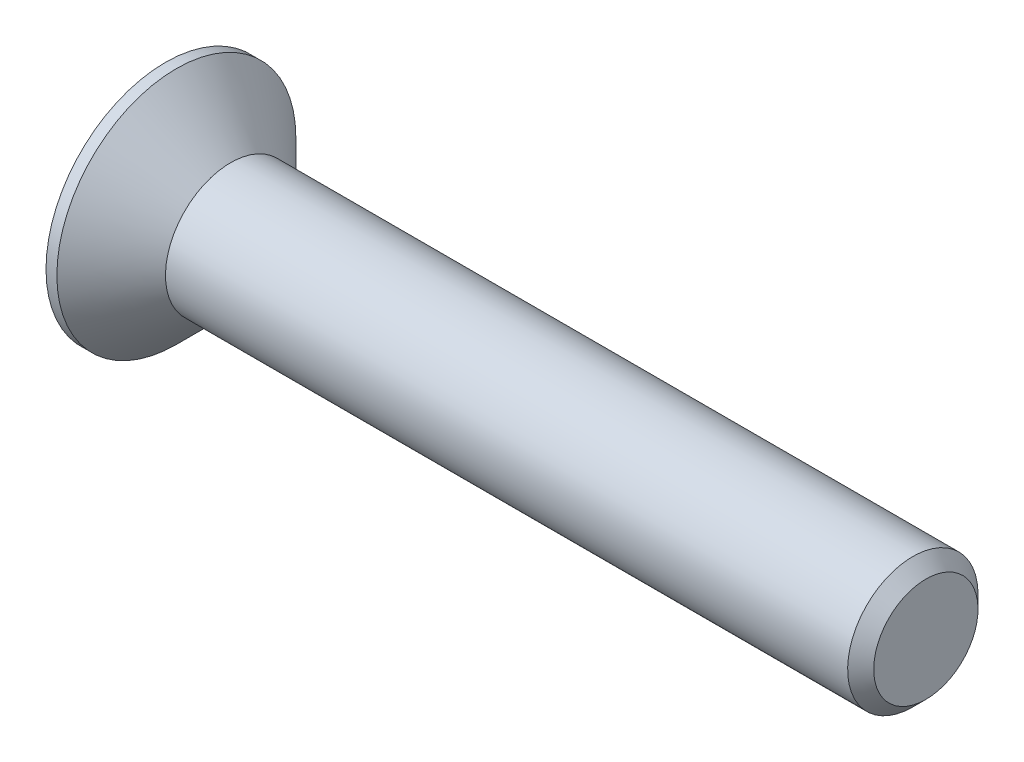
ISO-10303-21;
HEADER;
FILE_DESCRIPTION(('STEP AP214'),'2;1');
FILE_NAME('part.step','',(''),(''),'','','');
FILE_SCHEMA(('AUTOMOTIVE_DESIGN { 1 0 10303 214 1 1 1 1 }'));
ENDSEC;
DATA;
#1=APPLICATION_CONTEXT('core data for automotive mechanical design processes');
#2=APPLICATION_PROTOCOL_DEFINITION('international standard','automotive_design',2000,#1);
#3=PRODUCT_CONTEXT('',#1,'mechanical');
#4=PRODUCT('Part','Part','',(#3));
#5=PRODUCT_RELATED_PRODUCT_CATEGORY('part','',(#4));
#6=PRODUCT_DEFINITION_FORMATION('','',#4);
#7=PRODUCT_DEFINITION_CONTEXT('part definition',#1,'design');
#8=PRODUCT_DEFINITION('design','',#6,#7);
#9=PRODUCT_DEFINITION_SHAPE('','',#8);
#10=(LENGTH_UNIT() NAMED_UNIT(*) SI_UNIT(.MILLI.,.METRE.));
#11=(NAMED_UNIT(*) PLANE_ANGLE_UNIT() SI_UNIT($,.RADIAN.));
#12=(NAMED_UNIT(*) SI_UNIT($,.STERADIAN.) SOLID_ANGLE_UNIT());
#13=UNCERTAINTY_MEASURE_WITH_UNIT(LENGTH_MEASURE(1.E-05),#10,'distance_accuracy_value','');
#14=(GEOMETRIC_REPRESENTATION_CONTEXT(3) GLOBAL_UNCERTAINTY_ASSIGNED_CONTEXT((#13)) GLOBAL_UNIT_ASSIGNED_CONTEXT((#10,
#11,#12)) REPRESENTATION_CONTEXT('',''));
#15=CARTESIAN_POINT('',(0.,0.,0.));
#16=DIRECTION('',(0.,0.,1.));
#17=DIRECTION('',(1.,0.,0.));
#18=AXIS2_PLACEMENT_3D('',#15,#16,#17);
#19=CARTESIAN_POINT('',(0.,0.,0.));
#20=DIRECTION('',(-1.,0.,0.));
#21=DIRECTION('',(0.,-1.,0.));
#22=AXIS2_PLACEMENT_3D('',#19,#20,#21);
#23=CONICAL_SURFACE('',#22,3.,0.78539816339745);
#24=CARTESIAN_POINT('',(-2.49999999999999,0.,0.));
#25=DIRECTION('',(-1.,0.,0.));
#26=DIRECTION('',(0.,-1.,0.));
#27=AXIS2_PLACEMENT_3D('',#24,#25,#26);
#28=CIRCLE('',#27,5.5);
#29=CARTESIAN_POINT('',(-2.49999999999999,-5.5,0.));
#30=VERTEX_POINT('',#29);
#31=EDGE_CURVE('E189',#30,#30,#28,.T.);
#32=ORIENTED_EDGE('',*,*,#31,.F.);
#33=EDGE_LOOP('',(#32));
#34=FACE_BOUND('',#33,.T.);
#35=CARTESIAN_POINT('',(0.,0.,0.));
#36=DIRECTION('',(-1.,0.,0.));
#37=DIRECTION('',(0.,-1.,0.));
#38=AXIS2_PLACEMENT_3D('',#35,#36,#37);
#39=CIRCLE('',#38,3.);
#40=CARTESIAN_POINT('',(0.,-3.,0.));
#41=VERTEX_POINT('',#40);
#42=EDGE_CURVE('E212',#41,#41,#39,.T.);
#43=ORIENTED_EDGE('',*,*,#42,.T.);
#44=EDGE_LOOP('',(#43));
#45=FACE_BOUND('',#44,.T.);
#46=ADVANCED_FACE('F33',(#34,#45),#23,.T.);
#47=CARTESIAN_POINT('',(-3.,0.,0.));
#48=DIRECTION('',(-1.,0.,0.));
#49=DIRECTION('',(0.,-1.,0.));
#50=AXIS2_PLACEMENT_3D('',#47,#48,#49);
#51=CYLINDRICAL_SURFACE('',#50,3.);
#52=CARTESIAN_POINT('',(31.4,0.,0.));
#53=DIRECTION('',(-1.,0.,0.));
#54=DIRECTION('',(0.,-1.,0.));
#55=AXIS2_PLACEMENT_3D('',#52,#53,#54);
#56=CIRCLE('',#55,3.);
#57=CARTESIAN_POINT('',(31.4,-3.,0.));
#58=VERTEX_POINT('',#57);
#59=EDGE_CURVE('E41',#58,#58,#56,.T.);
#60=ORIENTED_EDGE('',*,*,#59,.T.);
#61=EDGE_LOOP('',(#60));
#62=FACE_BOUND('',#61,.T.);
#63=ORIENTED_EDGE('',*,*,#42,.F.);
#64=EDGE_LOOP('',(#63));
#65=FACE_BOUND('',#64,.T.);
#66=ADVANCED_FACE('F217',(#62,#65),#51,.T.);
#67=CARTESIAN_POINT('',(32.,0.,0.));
#68=DIRECTION('',(-1.,0.,0.));
#69=DIRECTION('',(0.,-1.,0.));
#70=AXIS2_PLACEMENT_3D('',#67,#68,#69);
#71=PLANE('',#70);
#72=CARTESIAN_POINT('',(32.,0.,0.));
#73=DIRECTION('',(-1.,0.,0.));
#74=DIRECTION('',(0.,-1.,0.));
#75=AXIS2_PLACEMENT_3D('',#72,#73,#74);
#76=CIRCLE('',#75,2.4);
#77=CARTESIAN_POINT('',(32.,-2.4,0.));
#78=VERTEX_POINT('',#77);
#79=EDGE_CURVE('E11',#78,#78,#76,.F.);
#80=ORIENTED_EDGE('',*,*,#79,.T.);
#81=EDGE_LOOP('',(#80));
#82=FACE_BOUND('',#81,.T.);
#83=ADVANCED_FACE('F239',(#82),#71,.F.);
#84=CARTESIAN_POINT('',(-3.,5.5,0.));
#85=DIRECTION('',(1.,0.,0.));
#86=DIRECTION('',(0.,1.,0.));
#87=AXIS2_PLACEMENT_3D('',#84,#85,#86);
#88=PLANE('',#87);
#89=DIRECTION('',(0.,0.,-1.));
#90=VECTOR('',#89,1.);
#91=CARTESIAN_POINT('',(-3.,0.825,-3.3));
#92=LINE('',#91,#90);
#93=CARTESIAN_POINT('',(-3.,0.825,-0.825));
#94=VERTEX_POINT('',#93);
#95=CARTESIAN_POINT('',(-3.,0.825,-3.3));
#96=VERTEX_POINT('',#95);
#97=EDGE_CURVE('E158',#94,#96,#92,.T.);
#98=ORIENTED_EDGE('',*,*,#97,.F.);
#99=DIRECTION('',(0.,-1.,0.));
#100=VECTOR('',#99,1.);
#101=CARTESIAN_POINT('',(-3.,0.825,-0.825));
#102=LINE('',#101,#100);
#103=CARTESIAN_POINT('',(-3.,3.3,-0.825));
#104=VERTEX_POINT('',#103);
#105=EDGE_CURVE('E48',#104,#94,#102,.T.);
#106=ORIENTED_EDGE('',*,*,#105,.F.);
#107=DIRECTION('',(0.,0.,-1.));
#108=VECTOR('',#107,1.);
#109=CARTESIAN_POINT('',(-3.,3.3,-0.825));
#110=LINE('',#109,#108);
#111=CARTESIAN_POINT('',(-3.,3.3,0.825));
#112=VERTEX_POINT('',#111);
#113=EDGE_CURVE('E185',#112,#104,#110,.T.);
#114=ORIENTED_EDGE('',*,*,#113,.F.);
#115=DIRECTION('',(0.,1.,0.));
#116=VECTOR('',#115,1.);
#117=CARTESIAN_POINT('',(-3.,3.3,0.825));
#118=LINE('',#117,#116);
#119=CARTESIAN_POINT('',(-3.,0.825,0.825));
#120=VERTEX_POINT('',#119);
#121=EDGE_CURVE('E183',#120,#112,#118,.T.);
#122=ORIENTED_EDGE('',*,*,#121,.F.);
#123=DIRECTION('',(0.,0.,-1.));
#124=VECTOR('',#123,1.);
#125=CARTESIAN_POINT('',(-3.,0.825,0.825));
#126=LINE('',#125,#124);
#127=CARTESIAN_POINT('',(-3.,0.825,3.3));
#128=VERTEX_POINT('',#127);
#129=EDGE_CURVE('E132',#128,#120,#126,.T.);
#130=ORIENTED_EDGE('',*,*,#129,.F.);
#131=DIRECTION('',(0.,1.,0.));
#132=VECTOR('',#131,1.);
#133=CARTESIAN_POINT('',(-3.,0.825,3.3));
#134=LINE('',#133,#132);
#135=CARTESIAN_POINT('',(-3.,-0.825,3.3));
#136=VERTEX_POINT('',#135);
#137=EDGE_CURVE('E179',#136,#128,#134,.T.);
#138=ORIENTED_EDGE('',*,*,#137,.F.);
#139=DIRECTION('',(0.,0.,1.));
#140=VECTOR('',#139,1.);
#141=CARTESIAN_POINT('',(-3.,-0.825,3.3));
#142=LINE('',#141,#140);
#143=CARTESIAN_POINT('',(-3.,-0.825,0.825));
#144=VERTEX_POINT('',#143);
#145=EDGE_CURVE('E176',#144,#136,#142,.T.);
#146=ORIENTED_EDGE('',*,*,#145,.F.);
#147=DIRECTION('',(0.,1.,0.));
#148=VECTOR('',#147,1.);
#149=CARTESIAN_POINT('',(-3.,-0.825,0.825));
#150=LINE('',#149,#148);
#151=CARTESIAN_POINT('',(-3.,-3.3,0.825));
#152=VERTEX_POINT('',#151);
#153=EDGE_CURVE('E173',#152,#144,#150,.T.);
#154=ORIENTED_EDGE('',*,*,#153,.F.);
#155=DIRECTION('',(0.,0.,1.));
#156=VECTOR('',#155,1.);
#157=CARTESIAN_POINT('',(-3.,-3.3,0.825));
#158=LINE('',#157,#156);
#159=CARTESIAN_POINT('',(-3.,-3.3,-0.825));
#160=VERTEX_POINT('',#159);
#161=EDGE_CURVE('E170',#160,#152,#158,.T.);
#162=ORIENTED_EDGE('',*,*,#161,.F.);
#163=DIRECTION('',(0.,-1.,0.));
#164=VECTOR('',#163,1.);
#165=CARTESIAN_POINT('',(-3.,-3.3,-0.825));
#166=LINE('',#165,#164);
#167=CARTESIAN_POINT('',(-3.,-0.825,-0.825));
#168=VERTEX_POINT('',#167);
#169=EDGE_CURVE('E167',#168,#160,#166,.T.);
#170=ORIENTED_EDGE('',*,*,#169,.F.);
#171=DIRECTION('',(0.,0.,1.));
#172=VECTOR('',#171,1.);
#173=CARTESIAN_POINT('',(-3.,-0.825,-0.825));
#174=LINE('',#173,#172);
#175=CARTESIAN_POINT('',(-3.,-0.825,-3.3));
#176=VERTEX_POINT('',#175);
#177=EDGE_CURVE('E164',#176,#168,#174,.T.);
#178=ORIENTED_EDGE('',*,*,#177,.F.);
#179=DIRECTION('',(0.,-1.,0.));
#180=VECTOR('',#179,1.);
#181=CARTESIAN_POINT('',(-3.,-0.825,-3.3));
#182=LINE('',#181,#180);
#183=EDGE_CURVE('E161',#96,#176,#182,.T.);
#184=ORIENTED_EDGE('',*,*,#183,.F.);
#185=EDGE_LOOP('',(#98,#106,#114,#122,#130,#138,#146,#154,#162,#170,#178,#184));
#186=FACE_BOUND('',#185,.T.);
#187=CARTESIAN_POINT('',(-3.,0.,0.));
#188=DIRECTION('',(-1.,0.,0.));
#189=DIRECTION('',(0.,-1.,0.));
#190=AXIS2_PLACEMENT_3D('',#187,#188,#189);
#191=CIRCLE('',#190,5.5);
#192=CARTESIAN_POINT('',(-3.,-5.5,0.));
#193=VERTEX_POINT('',#192);
#194=EDGE_CURVE('E209',#193,#193,#191,.T.);
#195=ORIENTED_EDGE('',*,*,#194,.T.);
#196=EDGE_LOOP('',(#195));
#197=FACE_BOUND('',#196,.T.);
#198=ADVANCED_FACE('F230',(#186,#197),#88,.F.);
#199=CARTESIAN_POINT('',(-3.,0.,0.));
#200=DIRECTION('',(-1.,0.,0.));
#201=DIRECTION('',(0.,-1.,0.));
#202=AXIS2_PLACEMENT_3D('',#199,#200,#201);
#203=CYLINDRICAL_SURFACE('',#202,5.5);
#204=ORIENTED_EDGE('',*,*,#194,.F.);
#205=EDGE_LOOP('',(#204));
#206=FACE_BOUND('',#205,.T.);
#207=ORIENTED_EDGE('',*,*,#31,.T.);
#208=EDGE_LOOP('',(#207));
#209=FACE_BOUND('',#208,.T.);
#210=ADVANCED_FACE('F222',(#206,#209),#203,.T.);
#211=CARTESIAN_POINT('',(31.4,0.,0.));
#212=DIRECTION('',(-1.,0.,0.));
#213=DIRECTION('',(0.,-1.,0.));
#214=AXIS2_PLACEMENT_3D('',#211,#212,#213);
#215=CONICAL_SURFACE('',#214,3.,0.785398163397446);
#216=ORIENTED_EDGE('',*,*,#79,.F.);
#217=EDGE_LOOP('',(#216));
#218=FACE_BOUND('',#217,.T.);
#219=ORIENTED_EDGE('',*,*,#59,.F.);
#220=EDGE_LOOP('',(#219));
#221=FACE_BOUND('',#220,.T.);
#222=ADVANCED_FACE('F35',(#218,#221),#215,.T.);
#223=CARTESIAN_POINT('',(-0.5,0.825,-0.825));
#224=DIRECTION('',(0.,0.,-1.));
#225=DIRECTION('',(-1.,0.,0.));
#226=AXIS2_PLACEMENT_3D('',#223,#224,#225);
#227=PLANE('',#226);
#228=ORIENTED_EDGE('',*,*,#105,.T.);
#229=DIRECTION('',(-1.,0.,0.));
#230=VECTOR('',#229,1.);
#231=CARTESIAN_POINT('',(-0.5,0.825,-0.825));
#232=LINE('',#231,#230);
#233=CARTESIAN_POINT('',(-0.5,0.825,-0.825));
#234=VERTEX_POINT('',#233);
#235=EDGE_CURVE('E96',#234,#94,#232,.T.);
#236=ORIENTED_EDGE('',*,*,#235,.F.);
#237=DIRECTION('',(0.,-1.,0.));
#238=VECTOR('',#237,1.);
#239=CARTESIAN_POINT('',(-0.5,0.825,-0.825));
#240=LINE('',#239,#238);
#241=CARTESIAN_POINT('',(-0.5,3.3,-0.825));
#242=VERTEX_POINT('',#241);
#243=EDGE_CURVE('E187',#242,#234,#240,.T.);
#244=ORIENTED_EDGE('',*,*,#243,.F.);
#245=DIRECTION('',(-1.,0.,0.));
#246=VECTOR('',#245,1.);
#247=CARTESIAN_POINT('',(-0.5,3.3,-0.825));
#248=LINE('',#247,#246);
#249=EDGE_CURVE('E56',#242,#104,#248,.T.);
#250=ORIENTED_EDGE('',*,*,#249,.T.);
#251=EDGE_LOOP('',(#228,#236,#244,#250));
#252=FACE_BOUND('',#251,.T.);
#253=ADVANCED_FACE('F221',(#252),#227,.F.);
#254=CARTESIAN_POINT('',(-0.5,3.3,-0.825));
#255=DIRECTION('',(0.,1.,0.));
#256=DIRECTION('',(-1.,0.,0.));
#257=AXIS2_PLACEMENT_3D('',#254,#255,#256);
#258=PLANE('',#257);
#259=ORIENTED_EDGE('',*,*,#113,.T.);
#260=ORIENTED_EDGE('',*,*,#249,.F.);
#261=DIRECTION('',(0.,0.,-1.));
#262=VECTOR('',#261,1.);
#263=CARTESIAN_POINT('',(-0.5,3.3,-0.825));
#264=LINE('',#263,#262);
#265=CARTESIAN_POINT('',(-0.5,3.3,0.825));
#266=VERTEX_POINT('',#265);
#267=EDGE_CURVE('E144',#266,#242,#264,.T.);
#268=ORIENTED_EDGE('',*,*,#267,.F.);
#269=DIRECTION('',(-1.,0.,0.));
#270=VECTOR('',#269,1.);
#271=CARTESIAN_POINT('',(-0.5,3.3,0.825));
#272=LINE('',#271,#270);
#273=EDGE_CURVE('E136',#266,#112,#272,.T.);
#274=ORIENTED_EDGE('',*,*,#273,.T.);
#275=EDGE_LOOP('',(#259,#260,#268,#274));
#276=FACE_BOUND('',#275,.T.);
#277=ADVANCED_FACE('F228',(#276),#258,.F.);
#278=CARTESIAN_POINT('',(-0.5,3.3,0.825));
#279=DIRECTION('',(0.,0.,1.));
#280=DIRECTION('',(1.,0.,0.));
#281=AXIS2_PLACEMENT_3D('',#278,#279,#280);
#282=PLANE('',#281);
#283=ORIENTED_EDGE('',*,*,#121,.T.);
#284=ORIENTED_EDGE('',*,*,#273,.F.);
#285=DIRECTION('',(0.,1.,0.));
#286=VECTOR('',#285,1.);
#287=CARTESIAN_POINT('',(-0.5,3.3,0.825));
#288=LINE('',#287,#286);
#289=CARTESIAN_POINT('',(-0.5,0.825,0.825));
#290=VERTEX_POINT('',#289);
#291=EDGE_CURVE('E140',#290,#266,#288,.T.);
#292=ORIENTED_EDGE('',*,*,#291,.F.);
#293=DIRECTION('',(-1.,0.,0.));
#294=VECTOR('',#293,1.);
#295=CARTESIAN_POINT('',(-0.5,0.825,0.825));
#296=LINE('',#295,#294);
#297=EDGE_CURVE('E125',#290,#120,#296,.T.);
#298=ORIENTED_EDGE('',*,*,#297,.T.);
#299=EDGE_LOOP('',(#283,#284,#292,#298));
#300=FACE_BOUND('',#299,.T.);
#301=ADVANCED_FACE('F141',(#300),#282,.F.);
#302=CARTESIAN_POINT('',(-0.5,0.825,0.825));
#303=DIRECTION('',(0.,1.,0.));
#304=DIRECTION('',(-1.,0.,0.));
#305=AXIS2_PLACEMENT_3D('',#302,#303,#304);
#306=PLANE('',#305);
#307=ORIENTED_EDGE('',*,*,#129,.T.);
#308=ORIENTED_EDGE('',*,*,#297,.F.);
#309=DIRECTION('',(0.,0.,-1.));
#310=VECTOR('',#309,1.);
#311=CARTESIAN_POINT('',(-0.5,0.825,0.825));
#312=LINE('',#311,#310);
#313=CARTESIAN_POINT('',(-0.5,0.825,3.3));
#314=VERTEX_POINT('',#313);
#315=EDGE_CURVE('E129',#314,#290,#312,.T.);
#316=ORIENTED_EDGE('',*,*,#315,.F.);
#317=DIRECTION('',(-1.,0.,0.));
#318=VECTOR('',#317,1.);
#319=CARTESIAN_POINT('',(-0.5,0.825,3.3));
#320=LINE('',#319,#318);
#321=EDGE_CURVE('E137',#314,#128,#320,.T.);
#322=ORIENTED_EDGE('',*,*,#321,.T.);
#323=EDGE_LOOP('',(#307,#308,#316,#322));
#324=FACE_BOUND('',#323,.T.);
#325=ADVANCED_FACE('F127',(#324),#306,.F.);
#326=CARTESIAN_POINT('',(-0.5,0.825,3.3));
#327=DIRECTION('',(0.,0.,1.));
#328=DIRECTION('',(1.,0.,0.));
#329=AXIS2_PLACEMENT_3D('',#326,#327,#328);
#330=PLANE('',#329);
#331=ORIENTED_EDGE('',*,*,#137,.T.);
#332=ORIENTED_EDGE('',*,*,#321,.F.);
#333=DIRECTION('',(0.,1.,0.));
#334=VECTOR('',#333,1.);
#335=CARTESIAN_POINT('',(-0.5,0.825,3.3));
#336=LINE('',#335,#334);
#337=CARTESIAN_POINT('',(-0.5,-0.825,3.3));
#338=VERTEX_POINT('',#337);
#339=EDGE_CURVE('E150',#338,#314,#336,.T.);
#340=ORIENTED_EDGE('',*,*,#339,.F.);
#341=DIRECTION('',(-1.,0.,0.));
#342=VECTOR('',#341,1.);
#343=CARTESIAN_POINT('',(-0.5,-0.825,3.3));
#344=LINE('',#343,#342);
#345=EDGE_CURVE('E192',#338,#136,#344,.T.);
#346=ORIENTED_EDGE('',*,*,#345,.T.);
#347=EDGE_LOOP('',(#331,#332,#340,#346));
#348=FACE_BOUND('',#347,.T.);
#349=ADVANCED_FACE('F277',(#348),#330,.F.);
#350=CARTESIAN_POINT('',(-0.5,-0.825,3.3));
#351=DIRECTION('',(0.,-1.,0.));
#352=DIRECTION('',(1.,0.,0.));
#353=AXIS2_PLACEMENT_3D('',#350,#351,#352);
#354=PLANE('',#353);
#355=ORIENTED_EDGE('',*,*,#145,.T.);
#356=ORIENTED_EDGE('',*,*,#345,.F.);
#357=DIRECTION('',(0.,0.,1.));
#358=VECTOR('',#357,1.);
#359=CARTESIAN_POINT('',(-0.5,-0.825,3.3));
#360=LINE('',#359,#358);
#361=CARTESIAN_POINT('',(-0.5,-0.825,0.825));
#362=VERTEX_POINT('',#361);
#363=EDGE_CURVE('E152',#362,#338,#360,.T.);
#364=ORIENTED_EDGE('',*,*,#363,.F.);
#365=DIRECTION('',(-1.,0.,0.));
#366=VECTOR('',#365,1.);
#367=CARTESIAN_POINT('',(-0.5,-0.825,0.825));
#368=LINE('',#367,#366);
#369=EDGE_CURVE('E194',#362,#144,#368,.T.);
#370=ORIENTED_EDGE('',*,*,#369,.T.);
#371=EDGE_LOOP('',(#355,#356,#364,#370));
#372=FACE_BOUND('',#371,.T.);
#373=ADVANCED_FACE('F273',(#372),#354,.F.);
#374=CARTESIAN_POINT('',(-0.5,-0.825,0.825));
#375=DIRECTION('',(0.,0.,1.));
#376=DIRECTION('',(1.,0.,0.));
#377=AXIS2_PLACEMENT_3D('',#374,#375,#376);
#378=PLANE('',#377);
#379=ORIENTED_EDGE('',*,*,#153,.T.);
#380=ORIENTED_EDGE('',*,*,#369,.F.);
#381=DIRECTION('',(0.,1.,0.));
#382=VECTOR('',#381,1.);
#383=CARTESIAN_POINT('',(-0.5,-0.825,0.825));
#384=LINE('',#383,#382);
#385=CARTESIAN_POINT('',(-0.5,-3.3,0.825));
#386=VERTEX_POINT('',#385);
#387=EDGE_CURVE('E422',#386,#362,#384,.T.);
#388=ORIENTED_EDGE('',*,*,#387,.F.);
#389=DIRECTION('',(-1.,0.,0.));
#390=VECTOR('',#389,1.);
#391=CARTESIAN_POINT('',(-0.5,-3.3,0.825));
#392=LINE('',#391,#390);
#393=EDGE_CURVE('E196',#386,#152,#392,.T.);
#394=ORIENTED_EDGE('',*,*,#393,.T.);
#395=EDGE_LOOP('',(#379,#380,#388,#394));
#396=FACE_BOUND('',#395,.T.);
#397=ADVANCED_FACE('F269',(#396),#378,.F.);
#398=CARTESIAN_POINT('',(-0.5,-3.3,0.825));
#399=DIRECTION('',(0.,-1.,0.));
#400=DIRECTION('',(1.,0.,0.));
#401=AXIS2_PLACEMENT_3D('',#398,#399,#400);
#402=PLANE('',#401);
#403=ORIENTED_EDGE('',*,*,#161,.T.);
#404=ORIENTED_EDGE('',*,*,#393,.F.);
#405=DIRECTION('',(0.,0.,1.));
#406=VECTOR('',#405,1.);
#407=CARTESIAN_POINT('',(-0.5,-3.3,0.825));
#408=LINE('',#407,#406);
#409=CARTESIAN_POINT('',(-0.5,-3.3,-0.825));
#410=VERTEX_POINT('',#409);
#411=EDGE_CURVE('E419',#410,#386,#408,.T.);
#412=ORIENTED_EDGE('',*,*,#411,.F.);
#413=DIRECTION('',(-1.,0.,0.));
#414=VECTOR('',#413,1.);
#415=CARTESIAN_POINT('',(-0.5,-3.3,-0.825));
#416=LINE('',#415,#414);
#417=EDGE_CURVE('E198',#410,#160,#416,.T.);
#418=ORIENTED_EDGE('',*,*,#417,.T.);
#419=EDGE_LOOP('',(#403,#404,#412,#418));
#420=FACE_BOUND('',#419,.T.);
#421=ADVANCED_FACE('F265',(#420),#402,.F.);
#422=CARTESIAN_POINT('',(-0.5,-3.3,-0.825));
#423=DIRECTION('',(0.,0.,-1.));
#424=DIRECTION('',(-1.,0.,0.));
#425=AXIS2_PLACEMENT_3D('',#422,#423,#424);
#426=PLANE('',#425);
#427=ORIENTED_EDGE('',*,*,#169,.T.);
#428=ORIENTED_EDGE('',*,*,#417,.F.);
#429=DIRECTION('',(0.,-1.,0.));
#430=VECTOR('',#429,1.);
#431=CARTESIAN_POINT('',(-0.5,-3.3,-0.825));
#432=LINE('',#431,#430);
#433=CARTESIAN_POINT('',(-0.5,-0.825,-0.825));
#434=VERTEX_POINT('',#433);
#435=EDGE_CURVE('E416',#434,#410,#432,.T.);
#436=ORIENTED_EDGE('',*,*,#435,.F.);
#437=DIRECTION('',(-1.,0.,0.));
#438=VECTOR('',#437,1.);
#439=CARTESIAN_POINT('',(-0.5,-0.825,-0.825));
#440=LINE('',#439,#438);
#441=EDGE_CURVE('E200',#434,#168,#440,.T.);
#442=ORIENTED_EDGE('',*,*,#441,.T.);
#443=EDGE_LOOP('',(#427,#428,#436,#442));
#444=FACE_BOUND('',#443,.T.);
#445=ADVANCED_FACE('F261',(#444),#426,.F.);
#446=CARTESIAN_POINT('',(-0.5,-0.825,-0.825));
#447=DIRECTION('',(0.,-1.,0.));
#448=DIRECTION('',(1.,0.,0.));
#449=AXIS2_PLACEMENT_3D('',#446,#447,#448);
#450=PLANE('',#449);
#451=ORIENTED_EDGE('',*,*,#177,.T.);
#452=ORIENTED_EDGE('',*,*,#441,.F.);
#453=DIRECTION('',(0.,0.,1.));
#454=VECTOR('',#453,1.);
#455=CARTESIAN_POINT('',(-0.5,-0.825,-0.825));
#456=LINE('',#455,#454);
#457=CARTESIAN_POINT('',(-0.5,-0.825,-3.3));
#458=VERTEX_POINT('',#457);
#459=EDGE_CURVE('E413',#458,#434,#456,.T.);
#460=ORIENTED_EDGE('',*,*,#459,.F.);
#461=DIRECTION('',(-1.,0.,0.));
#462=VECTOR('',#461,1.);
#463=CARTESIAN_POINT('',(-0.5,-0.825,-3.3));
#464=LINE('',#463,#462);
#465=EDGE_CURVE('E202',#458,#176,#464,.T.);
#466=ORIENTED_EDGE('',*,*,#465,.T.);
#467=EDGE_LOOP('',(#451,#452,#460,#466));
#468=FACE_BOUND('',#467,.T.);
#469=ADVANCED_FACE('F257',(#468),#450,.F.);
#470=CARTESIAN_POINT('',(-0.5,-0.825,-3.3));
#471=DIRECTION('',(0.,0.,-1.));
#472=DIRECTION('',(-1.,0.,0.));
#473=AXIS2_PLACEMENT_3D('',#470,#471,#472);
#474=PLANE('',#473);
#475=ORIENTED_EDGE('',*,*,#183,.T.);
#476=ORIENTED_EDGE('',*,*,#465,.F.);
#477=DIRECTION('',(0.,-1.,0.));
#478=VECTOR('',#477,1.);
#479=CARTESIAN_POINT('',(-0.5,-0.825,-3.3));
#480=LINE('',#479,#478);
#481=CARTESIAN_POINT('',(-0.5,0.825,-3.3));
#482=VERTEX_POINT('',#481);
#483=EDGE_CURVE('E408',#482,#458,#480,.T.);
#484=ORIENTED_EDGE('',*,*,#483,.F.);
#485=DIRECTION('',(-1.,0.,0.));
#486=VECTOR('',#485,1.);
#487=CARTESIAN_POINT('',(-0.5,0.825,-3.3));
#488=LINE('',#487,#486);
#489=EDGE_CURVE('E204',#482,#96,#488,.T.);
#490=ORIENTED_EDGE('',*,*,#489,.T.);
#491=EDGE_LOOP('',(#475,#476,#484,#490));
#492=FACE_BOUND('',#491,.T.);
#493=ADVANCED_FACE('F253',(#492),#474,.F.);
#494=CARTESIAN_POINT('',(-0.5,0.825,-3.3));
#495=DIRECTION('',(0.,1.,0.));
#496=DIRECTION('',(-1.,0.,0.));
#497=AXIS2_PLACEMENT_3D('',#494,#495,#496);
#498=PLANE('',#497);
#499=ORIENTED_EDGE('',*,*,#97,.T.);
#500=ORIENTED_EDGE('',*,*,#489,.F.);
#501=DIRECTION('',(0.,0.,-1.));
#502=VECTOR('',#501,1.);
#503=CARTESIAN_POINT('',(-0.5,0.825,-3.3));
#504=LINE('',#503,#502);
#505=EDGE_CURVE('E406',#234,#482,#504,.T.);
#506=ORIENTED_EDGE('',*,*,#505,.F.);
#507=ORIENTED_EDGE('',*,*,#235,.T.);
#508=EDGE_LOOP('',(#499,#500,#506,#507));
#509=FACE_BOUND('',#508,.T.);
#510=ADVANCED_FACE('F250',(#509),#498,.F.);
#511=CARTESIAN_POINT('',(-0.5,0.,0.));
#512=DIRECTION('',(1.,0.,0.));
#513=DIRECTION('',(0.,0.,-1.));
#514=AXIS2_PLACEMENT_3D('',#511,#512,#513);
#515=PLANE('',#514);
#516=ORIENTED_EDGE('',*,*,#243,.T.);
#517=ORIENTED_EDGE('',*,*,#505,.T.);
#518=ORIENTED_EDGE('',*,*,#483,.T.);
#519=ORIENTED_EDGE('',*,*,#459,.T.);
#520=ORIENTED_EDGE('',*,*,#435,.T.);
#521=ORIENTED_EDGE('',*,*,#411,.T.);
#522=ORIENTED_EDGE('',*,*,#387,.T.);
#523=ORIENTED_EDGE('',*,*,#363,.T.);
#524=ORIENTED_EDGE('',*,*,#339,.T.);
#525=ORIENTED_EDGE('',*,*,#315,.T.);
#526=ORIENTED_EDGE('',*,*,#291,.T.);
#527=ORIENTED_EDGE('',*,*,#267,.T.);
#528=EDGE_LOOP('',(#516,#517,#518,#519,#520,#521,#522,#523,#524,#525,#526,#527));
#529=FACE_BOUND('',#528,.T.);
#530=ADVANCED_FACE('F147',(#529),#515,.F.);
#531=CLOSED_SHELL('',(#46,#66,#83,#198,#210,#222,#253,#277,#301,#325,#349,#373,#397,#421,#445,
#469,#493,#510,#530));
#532=MANIFOLD_SOLID_BREP('B2',#531);
#533=ADVANCED_BREP_SHAPE_REPRESENTATION('',(#18,#532),#14);
#534=SHAPE_DEFINITION_REPRESENTATION(#9,#533);
ENDSEC;
END-ISO-10303-21;
